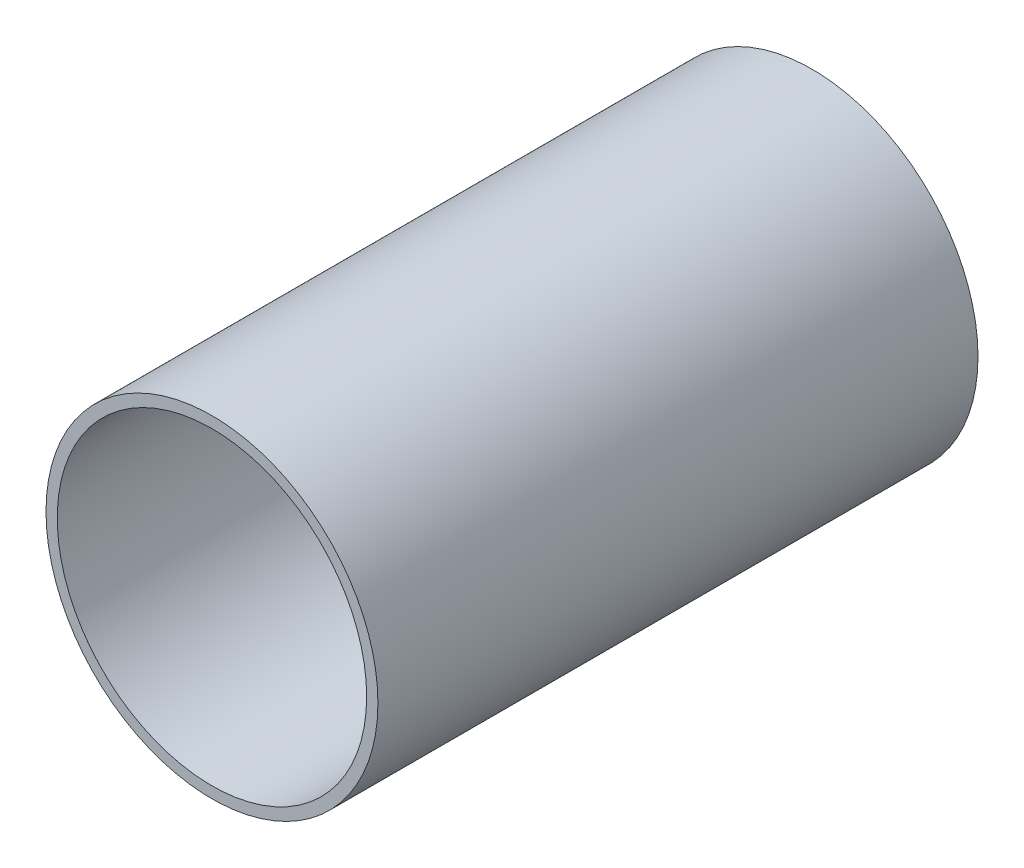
from build123d import *

# Parameters (mm, degrees)
SKETCH1_R           = 56.1975
SKETCH1_R_2         = 52.3875
BOSS_EXTRUDE1_DEPTH = 203.2


with BuildPart() as part:
    # Sketch1 → Boss-Extrude1 (new body)
    with BuildSketch(Plane.XY):
        Circle(SKETCH1_R)
        Circle(SKETCH1_R_2, mode=Mode.SUBTRACT)
    extrude(amount=-BOSS_EXTRUDE1_DEPTH)


solid = part.part
